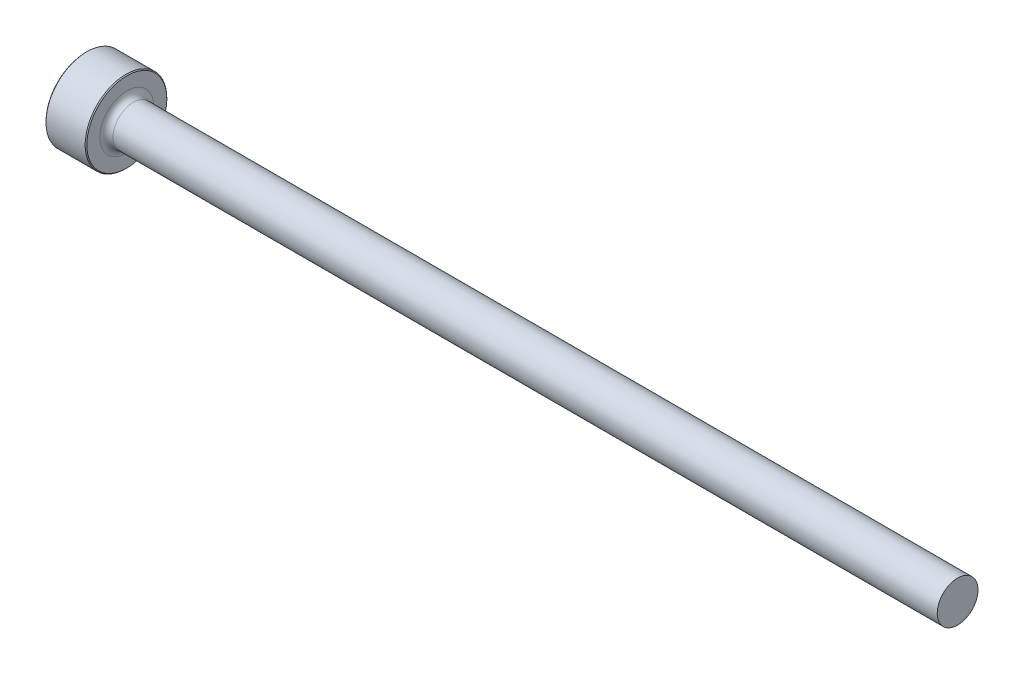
from build123d import *

# Parameters (mm, degrees)
CHAMFER1_SIZE = 0.1016


with BuildPart() as part:
    # Sketch1 → Revolve1 (revolve)
    with BuildSketch(Plane.XY):
        with BuildLine():
            Line((0, 0), (0, 4.7625))
            Line((0, 4.7625), (4.7625, 4.7625))
            Line((4.7625, 4.7625), (4.7625, 3.13944))
            ThreePointArc((4.7625, 3.13944), (4.985684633, 2.600624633), (5.5245, 2.37744))
            Line((5.5245, 2.37744), (101.6, 2.37744))
            Line((101.6, 2.37744), (101.6, 0))
            Line((101.6, 0), (0, 0))
        make_face()
    revolve(axis=Axis((101.6, 0, 0), (-1, 0, 0)))

    # Chamfer1
    chamfer1_edges = [part.edges().sort_by_distance(p)[0] for p in [
        (0, -4.7625, 0),
        (4.7625, -4.7625, 0),
    ]]
    chamfer(chamfer1_edges, length=CHAMFER1_SIZE)


solid = part.part
